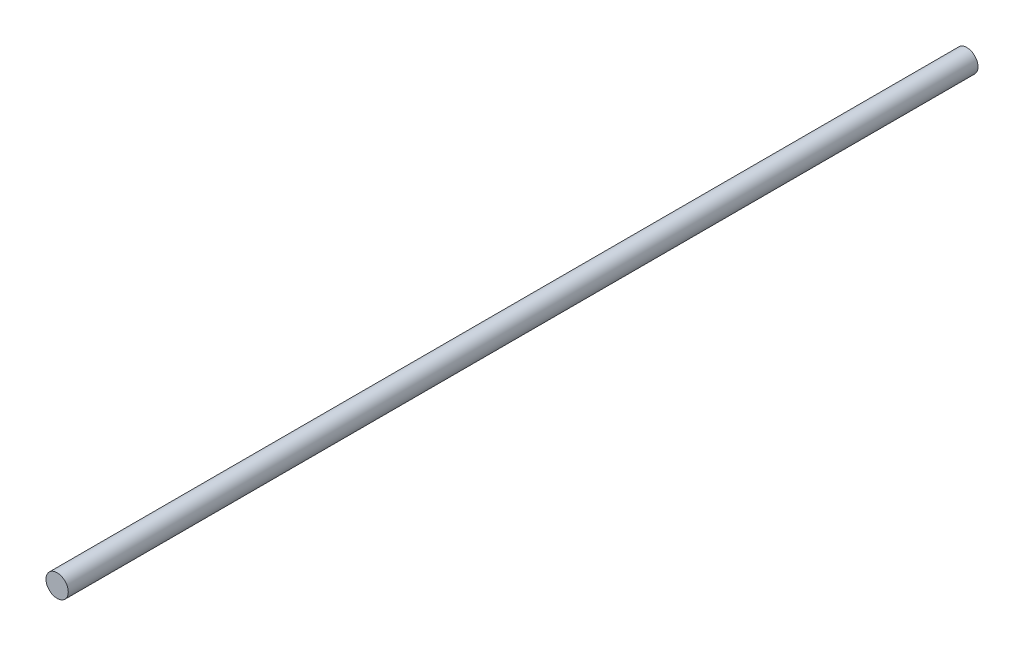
from build123d import *

# Parameters (mm, degrees)
BOSS_EXTRUDE1_DEPTH      = 200
BOSS_EXTRUDE1_DEPTH_BACK = 200
SKETCH1_R                = 4.9


with BuildPart() as part:
    # Sketch1 → Boss-Extrude1 (new, two sides: drawn at the far end of the back side and taken through both)
    with BuildSketch(Plane.XY.offset(-BOSS_EXTRUDE1_DEPTH_BACK)):
        with Locations((80, 15)):
            Circle(SKETCH1_R)
    extrude(amount=BOSS_EXTRUDE1_DEPTH + BOSS_EXTRUDE1_DEPTH_BACK)


solid = part.part
